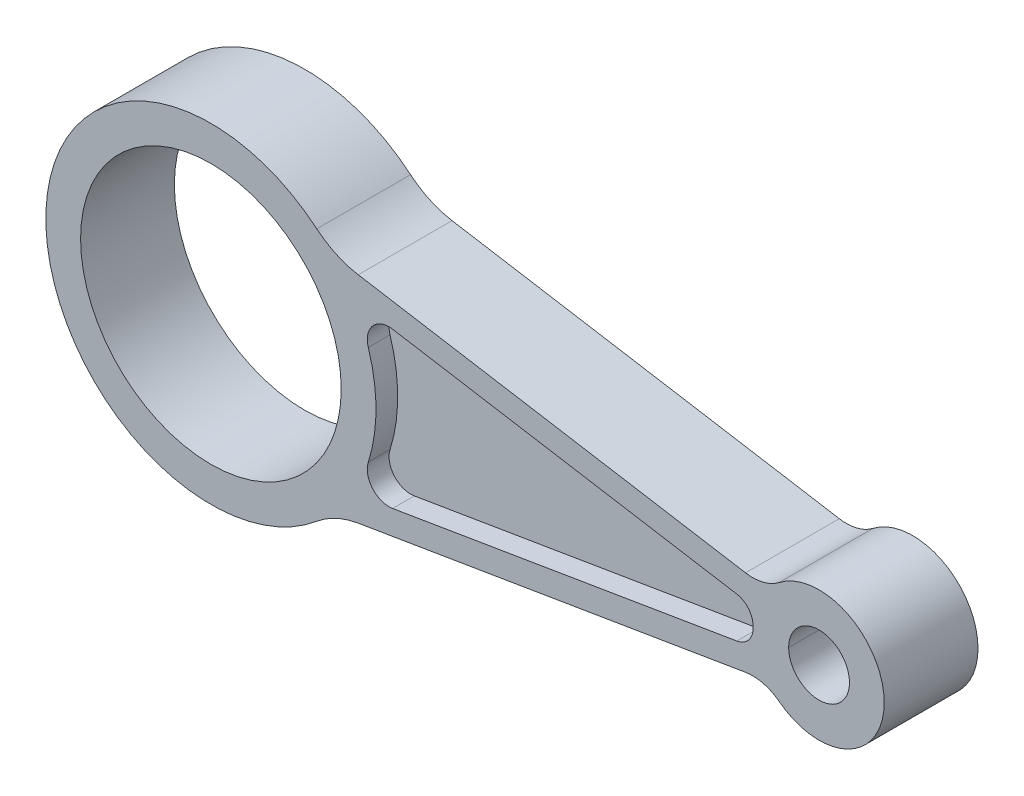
from build123d import *

# Parameters (mm, degrees)
SKETCH1_R          = 30
SKETCH1_R_2        = 7
BASE_EXTRUDE_DEPTH = 21.589828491
FILLET1_R          = 10
FILLET2_R          = 20
CUT_EXTRUDE1_DEPTH = 5
CUT_EXTRUDE2_START = -5
CUT_EXTRUDE2_DEPTH = 5


with BuildPart() as part:
    # Sketch1 → Base-Extrude (new body)
    with BuildSketch(Plane.XY):
        with BuildLine():
            Line((27.935473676, 25.760615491), (128.063755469, 9.084385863))
            ThreePointArc((128.063755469, 9.084385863), (155, 0), (128.063755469, -9.084385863))
            Line((128.063755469, -9.084385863), (27.935473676, -25.760615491))
            ThreePointArc((27.935473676, -25.760615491), (-38, 0), (27.935473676, 25.760615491))
        make_face()
        Circle(SKETCH1_R, mode=Mode.SUBTRACT)
        with Locations((140, 0)):
            Circle(SKETCH1_R_2, mode=Mode.SUBTRACT)
    extrude(amount=-BASE_EXTRUDE_DEPTH)

    # Fillet1
    fillet1_edges = [part.edges().sort_by_distance(p)[0] for p in [
        (128.063755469, 9.084385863, -10.794914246),
        (128.063755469, -9.084385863, -10.794914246),
    ]]
    fillet(fillet1_edges, radius=FILLET1_R)

    # Fillet2
    fillet2_edges = [part.edges().sort_by_distance(p)[0] for p in [
        (27.935473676, 25.760615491, -10.794914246),
        (27.935473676, -25.760615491, -10.794914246),
    ]]
    fillet(fillet2_edges, radius=FILLET2_R)

    # Sketch2 → Cut-Extrude1 (cut)
    with BuildSketch(Plane.XY):
        with BuildLine():
            Line((41.828554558, 17.870982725), (121.046940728, 4.677267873))
            ThreePointArc((121.046940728, 4.677267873), (123.741079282, 3.147292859), (124.807655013, 0.238406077))
            ThreePointArc((124.807655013, 0.238406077), (123.914202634, -2.958553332), (121.071833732, -4.673121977))
            Line((121.071833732, -4.673121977), (41.828554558, -17.870982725))
            ThreePointArc((41.828554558, -17.870982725), (37.231968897, -16.217361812), (36.238855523, -11.43439331))
            ThreePointArc((36.238855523, -11.43439331), (38, 0), (36.238855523, 11.43439331))
            ThreePointArc((36.238855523, 11.43439331), (37.231968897, 16.217361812), (41.828554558, 17.870982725))
        make_face()
    extrude(amount=-CUT_EXTRUDE1_DEPTH, mode=Mode.SUBTRACT)

    # Sketch3 → Cut-Extrude2 (cut)
    with BuildSketch(Plane(origin=(0, 0, -21.589828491), x_dir=(-1, 0, 0), z_dir=(0, 0, -1)).offset(CUT_EXTRUDE2_START)):
        with BuildLine():
            Line((-121.445609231, 4.610870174), (-41.828554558, 17.870982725))
            ThreePointArc((-41.828554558, 17.870982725), (-37.231968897, 16.217361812), (-36.238855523, 11.43439331))
            ThreePointArc((-36.238855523, 11.43439331), (-38, 0), (-36.238855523, -11.43439331))
            ThreePointArc((-36.238855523, -11.43439331), (-37.231968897, -16.217361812), (-41.828554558, -17.870982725))
            Line((-41.828554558, -17.870982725), (-121.433526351, -4.612882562))
            ThreePointArc((-121.433526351, -4.612882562), (-124.132861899, -3.076762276), (-125.194211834, -0.157924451))
            ThreePointArc((-125.194211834, -0.157924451), (-124.244145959, 2.952985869), (-121.445609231, 4.610870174))
        make_face()
    extrude(amount=CUT_EXTRUDE2_DEPTH, mode=Mode.SUBTRACT)


solid = part.part
